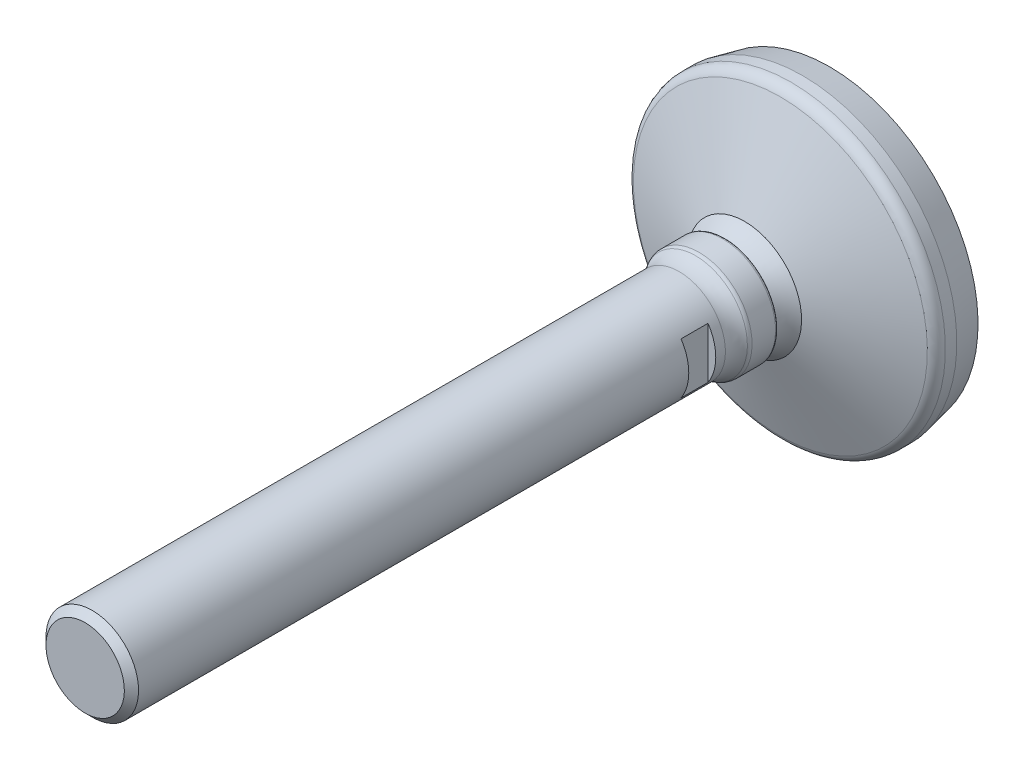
ISO-10303-21;
HEADER;
FILE_DESCRIPTION(('STEP AP214'),'2;1');
FILE_NAME('part.step','',(''),(''),'','','');
FILE_SCHEMA(('AUTOMOTIVE_DESIGN { 1 0 10303 214 1 1 1 1 }'));
ENDSEC;
DATA;
#1=APPLICATION_CONTEXT('core data for automotive mechanical design processes');
#2=APPLICATION_PROTOCOL_DEFINITION('international standard','automotive_design',2000,#1);
#3=PRODUCT_CONTEXT('',#1,'mechanical');
#4=PRODUCT('Part','Part','',(#3));
#5=PRODUCT_RELATED_PRODUCT_CATEGORY('part','',(#4));
#6=PRODUCT_DEFINITION_FORMATION('','',#4);
#7=PRODUCT_DEFINITION_CONTEXT('part definition',#1,'design');
#8=PRODUCT_DEFINITION('design','',#6,#7);
#9=PRODUCT_DEFINITION_SHAPE('','',#8);
#10=(LENGTH_UNIT() NAMED_UNIT(*) SI_UNIT(.MILLI.,.METRE.));
#11=(NAMED_UNIT(*) PLANE_ANGLE_UNIT() SI_UNIT($,.RADIAN.));
#12=(NAMED_UNIT(*) SI_UNIT($,.STERADIAN.) SOLID_ANGLE_UNIT());
#13=UNCERTAINTY_MEASURE_WITH_UNIT(LENGTH_MEASURE(1.E-05),#10,'distance_accuracy_value','');
#14=(GEOMETRIC_REPRESENTATION_CONTEXT(3) GLOBAL_UNCERTAINTY_ASSIGNED_CONTEXT((#13)) GLOBAL_UNIT_ASSIGNED_CONTEXT((#10,
#11,#12)) REPRESENTATION_CONTEXT('',''));
#15=CARTESIAN_POINT('',(0.,0.,0.));
#16=DIRECTION('',(0.,0.,1.));
#17=DIRECTION('',(1.,0.,0.));
#18=AXIS2_PLACEMENT_3D('',#15,#16,#17);
#19=CARTESIAN_POINT('',(0.,0.,30.1171837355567));
#20=DIRECTION('',(0.,0.,-1.));
#21=DIRECTION('',(0.,1.,0.));
#22=AXIS2_PLACEMENT_3D('',#19,#20,#21);
#23=TOROIDAL_SURFACE('',#22,23.5880613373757,12.);
#24=CARTESIAN_POINT('',(0.,0.,22.));
#25=DIRECTION('',(0.,0.,-1.));
#26=DIRECTION('',(0.,1.,0.));
#27=AXIS2_PLACEMENT_3D('',#24,#25,#26);
#28=CIRCLE('',#27,14.75);
#29=CARTESIAN_POINT('',(0.,14.75,22.));
#30=VERTEX_POINT('',#29);
#31=EDGE_CURVE('E86',#30,#30,#28,.T.);
#32=ORIENTED_EDGE('',*,*,#31,.F.);
#33=EDGE_LOOP('',(#32));
#34=FACE_BOUND('',#33,.T.);
#35=CARTESIAN_POINT('',(0.,0.,27.));
#36=DIRECTION('',(0.,0.,-1.));
#37=DIRECTION('',(0.,1.,0.));
#38=AXIS2_PLACEMENT_3D('',#35,#36,#37);
#39=CIRCLE('',#38,12.);
#40=CARTESIAN_POINT('',(0.,12.,27.));
#41=VERTEX_POINT('',#40);
#42=EDGE_CURVE('E61',#41,#41,#39,.T.);
#43=ORIENTED_EDGE('',*,*,#42,.T.);
#44=EDGE_LOOP('',(#43));
#45=FACE_BOUND('',#44,.T.);
#46=ADVANCED_FACE('F14',(#34,#45),#23,.F.);
#47=CARTESIAN_POINT('',(0.,0.,22.));
#48=DIRECTION('',(0.,0.,-1.));
#49=DIRECTION('',(0.,1.,0.));
#50=AXIS2_PLACEMENT_3D('',#47,#48,#49);
#51=CONICAL_SURFACE('',#50,14.75,1.19370873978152);
#52=CARTESIAN_POINT('',(0.,0.,12.7506365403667));
#53=DIRECTION('',(0.,0.,-1.));
#54=DIRECTION('',(0.,1.,0.));
#55=AXIS2_PLACEMENT_3D('',#52,#53,#54);
#56=CIRCLE('',#55,38.104642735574);
#57=CARTESIAN_POINT('',(0.,38.104642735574,12.7506365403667));
#58=VERTEX_POINT('',#57);
#59=EDGE_CURVE('E89',#58,#58,#56,.T.);
#60=ORIENTED_EDGE('',*,*,#59,.F.);
#61=EDGE_LOOP('',(#60));
#62=FACE_BOUND('',#61,.T.);
#63=ORIENTED_EDGE('',*,*,#31,.T.);
#64=EDGE_LOOP('',(#63));
#65=FACE_BOUND('',#64,.T.);
#66=ADVANCED_FACE('F147',(#62,#65),#51,.T.);
#67=CARTESIAN_POINT('',(0.,0.,9.96141363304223));
#68=DIRECTION('',(0.,0.,-1.));
#69=DIRECTION('',(0.,1.,0.));
#70=AXIS2_PLACEMENT_3D('',#67,#68,#69);
#71=TOROIDAL_SURFACE('',#70,37.,3.00000000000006);
#72=ORIENTED_EDGE('',*,*,#59,.T.);
#73=EDGE_LOOP('',(#72));
#74=FACE_BOUND('',#73,.T.);
#75=CARTESIAN_POINT('',(0.,0.,9.96141363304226));
#76=DIRECTION('',(0.,0.,-1.));
#77=DIRECTION('',(0.,1.,0.));
#78=AXIS2_PLACEMENT_3D('',#75,#76,#77);
#79=CIRCLE('',#78,40.);
#80=CARTESIAN_POINT('',(0.,40.,9.96141363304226));
#81=VERTEX_POINT('',#80);
#82=EDGE_CURVE('E92',#81,#81,#79,.T.);
#83=ORIENTED_EDGE('',*,*,#82,.F.);
#84=EDGE_LOOP('',(#83));
#85=FACE_BOUND('',#84,.T.);
#86=ADVANCED_FACE('F153',(#74,#85),#71,.T.);
#87=CARTESIAN_POINT('',(0.,0.,0.));
#88=DIRECTION('',(0.,0.,-1.));
#89=DIRECTION('',(0.,1.,0.));
#90=AXIS2_PLACEMENT_3D('',#87,#88,#89);
#91=CYLINDRICAL_SURFACE('',#90,40.);
#92=CARTESIAN_POINT('',(0.,0.,7.));
#93=DIRECTION('',(0.,0.,-1.));
#94=DIRECTION('',(0.,1.,0.));
#95=AXIS2_PLACEMENT_3D('',#92,#93,#94);
#96=CIRCLE('',#95,40.);
#97=CARTESIAN_POINT('',(0.,40.,7.));
#98=VERTEX_POINT('',#97);
#99=EDGE_CURVE('E95',#98,#98,#96,.T.);
#100=ORIENTED_EDGE('',*,*,#99,.F.);
#101=EDGE_LOOP('',(#100));
#102=FACE_BOUND('',#101,.T.);
#103=ORIENTED_EDGE('',*,*,#82,.T.);
#104=EDGE_LOOP('',(#103));
#105=FACE_BOUND('',#104,.T.);
#106=ADVANCED_FACE('F198',(#102,#105),#91,.T.);
#107=CARTESIAN_POINT('',(0.,0.,7.));
#108=DIRECTION('',(0.,0.,1.));
#109=DIRECTION('',(0.,-1.,0.));
#110=AXIS2_PLACEMENT_3D('',#107,#108,#109);
#111=CONICAL_SURFACE('',#110,40.,0.211093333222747);
#112=CARTESIAN_POINT('',(0.,0.,0.));
#113=DIRECTION('',(0.,0.,-1.));
#114=DIRECTION('',(0.,1.,0.));
#115=AXIS2_PLACEMENT_3D('',#112,#113,#114);
#116=CIRCLE('',#115,38.5);
#117=CARTESIAN_POINT('',(0.,38.5,0.));
#118=VERTEX_POINT('',#117);
#119=EDGE_CURVE('E98',#118,#118,#116,.T.);
#120=ORIENTED_EDGE('',*,*,#119,.F.);
#121=EDGE_LOOP('',(#120));
#122=FACE_BOUND('',#121,.T.);
#123=ORIENTED_EDGE('',*,*,#99,.T.);
#124=EDGE_LOOP('',(#123));
#125=FACE_BOUND('',#124,.T.);
#126=ADVANCED_FACE('F194',(#122,#125),#111,.T.);
#127=CARTESIAN_POINT('',(38.5,0.,0.));
#128=DIRECTION('',(0.,0.,1.));
#129=DIRECTION('',(0.,-1.,0.));
#130=AXIS2_PLACEMENT_3D('',#127,#128,#129);
#131=PLANE('',#130);
#132=ORIENTED_EDGE('',*,*,#119,.T.);
#133=EDGE_LOOP('',(#132));
#134=FACE_BOUND('',#133,.T.);
#135=ADVANCED_FACE('F187',(#134),#131,.F.);
#136=CARTESIAN_POINT('',(0.,0.,12.5));
#137=DIRECTION('',(0.,0.,-1.));
#138=DIRECTION('',(0.,1.,0.));
#139=AXIS2_PLACEMENT_3D('',#136,#137,#138);
#140=CYLINDRICAL_SURFACE('',#139,12.);
#141=CARTESIAN_POINT('',(0.,0.,39.));
#142=DIRECTION('',(0.,0.,-1.));
#143=DIRECTION('',(0.,1.,0.));
#144=AXIS2_PLACEMENT_3D('',#141,#142,#143);
#145=CIRCLE('',#144,12.);
#146=CARTESIAN_POINT('',(0.,12.,39.));
#147=VERTEX_POINT('',#146);
#148=EDGE_CURVE('E107',#147,#147,#145,.T.);
#149=ORIENTED_EDGE('',*,*,#148,.F.);
#150=EDGE_LOOP('',(#149));
#151=FACE_BOUND('',#150,.T.);
#152=DIRECTION('',(0.,0.,-1.));
#153=VECTOR('',#152,1.);
#154=CARTESIAN_POINT('',(10.,-6.6332495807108,12.5));
#155=LINE('',#154,#153);
#156=CARTESIAN_POINT('',(10.,-6.6332495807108,41.5));
#157=VERTEX_POINT('',#156);
#158=CARTESIAN_POINT('',(10.,-6.6332495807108,48.5));
#159=VERTEX_POINT('',#158);
#160=EDGE_CURVE('E77',#157,#159,#155,.F.);
#161=ORIENTED_EDGE('',*,*,#160,.T.);
#162=CARTESIAN_POINT('',(0.,0.,48.5));
#163=DIRECTION('',(0.,0.,1.));
#164=DIRECTION('',(0.,-1.,0.));
#165=AXIS2_PLACEMENT_3D('',#162,#163,#164);
#166=CIRCLE('',#165,12.);
#167=CARTESIAN_POINT('',(10.,6.6332495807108,48.5));
#168=VERTEX_POINT('',#167);
#169=EDGE_CURVE('E9',#159,#168,#166,.T.);
#170=ORIENTED_EDGE('',*,*,#169,.T.);
#171=DIRECTION('',(0.,0.,-1.));
#172=VECTOR('',#171,1.);
#173=CARTESIAN_POINT('',(10.,6.6332495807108,12.5));
#174=LINE('',#173,#172);
#175=CARTESIAN_POINT('',(10.,6.6332495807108,41.5));
#176=VERTEX_POINT('',#175);
#177=EDGE_CURVE('E17',#168,#176,#174,.T.);
#178=ORIENTED_EDGE('',*,*,#177,.T.);
#179=CARTESIAN_POINT('',(0.,0.,41.5));
#180=DIRECTION('',(0.,0.,1.));
#181=DIRECTION('',(0.,-1.,0.));
#182=AXIS2_PLACEMENT_3D('',#179,#180,#181);
#183=CIRCLE('',#182,12.);
#184=EDGE_CURVE('E63',#157,#176,#183,.T.);
#185=ORIENTED_EDGE('',*,*,#184,.F.);
#186=EDGE_LOOP('',(#161,#170,#178,#185));
#187=FACE_BOUND('',#186,.T.);
#188=DIRECTION('',(0.,0.,-1.));
#189=VECTOR('',#188,1.);
#190=CARTESIAN_POINT('',(-10.,6.6332495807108,12.5));
#191=LINE('',#190,#189);
#192=CARTESIAN_POINT('',(-10.,6.6332495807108,41.5));
#193=VERTEX_POINT('',#192);
#194=CARTESIAN_POINT('',(-10.,6.6332495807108,48.5));
#195=VERTEX_POINT('',#194);
#196=EDGE_CURVE('E60',#193,#195,#191,.F.);
#197=ORIENTED_EDGE('',*,*,#196,.T.);
#198=CARTESIAN_POINT('',(-10.,-6.6332495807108,48.5));
#199=VERTEX_POINT('',#198);
#200=EDGE_CURVE('E23',#195,#199,#166,.T.);
#201=ORIENTED_EDGE('',*,*,#200,.T.);
#202=DIRECTION('',(0.,0.,-1.));
#203=VECTOR('',#202,1.);
#204=CARTESIAN_POINT('',(-10.,-6.6332495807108,12.5));
#205=LINE('',#204,#203);
#206=CARTESIAN_POINT('',(-10.,-6.6332495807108,41.5));
#207=VERTEX_POINT('',#206);
#208=EDGE_CURVE('E67',#199,#207,#205,.T.);
#209=ORIENTED_EDGE('',*,*,#208,.T.);
#210=EDGE_CURVE('E55',#193,#207,#183,.T.);
#211=ORIENTED_EDGE('',*,*,#210,.F.);
#212=EDGE_LOOP('',(#197,#201,#209,#211));
#213=FACE_BOUND('',#212,.T.);
#214=CARTESIAN_POINT('',(0.,0.,191.1595));
#215=DIRECTION('',(0.,0.,-1.));
#216=DIRECTION('',(0.,1.,0.));
#217=AXIS2_PLACEMENT_3D('',#214,#215,#216);
#218=CIRCLE('',#217,12.);
#219=CARTESIAN_POINT('',(0.,12.,191.1595));
#220=VERTEX_POINT('',#219);
#221=EDGE_CURVE('E104',#220,#220,#218,.T.);
#222=ORIENTED_EDGE('',*,*,#221,.T.);
#223=EDGE_LOOP('',(#222));
#224=FACE_BOUND('',#223,.T.);
#225=ADVANCED_FACE('F73',(#151,#187,#213,#224),#140,.T.);
#226=CARTESIAN_POINT('',(0.,0.,39.));
#227=DIRECTION('',(0.,0.,-1.));
#228=DIRECTION('',(0.,1.,0.));
#229=AXIS2_PLACEMENT_3D('',#226,#227,#228);
#230=TOROIDAL_SURFACE('',#229,19.,7.);
#231=CARTESIAN_POINT('',(0.,0.,34.7456515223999));
#232=DIRECTION('',(0.,0.,-1.));
#233=DIRECTION('',(0.,1.,0.));
#234=AXIS2_PLACEMENT_3D('',#231,#232,#233);
#235=CIRCLE('',#234,13.4411764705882);
#236=CARTESIAN_POINT('',(0.,13.4411764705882,34.7456515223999));
#237=VERTEX_POINT('',#236);
#238=EDGE_CURVE('E110',#237,#237,#235,.T.);
#239=ORIENTED_EDGE('',*,*,#238,.F.);
#240=EDGE_LOOP('',(#239));
#241=FACE_BOUND('',#240,.T.);
#242=ORIENTED_EDGE('',*,*,#148,.T.);
#243=EDGE_LOOP('',(#242));
#244=FACE_BOUND('',#243,.T.);
#245=ADVANCED_FACE('F180',(#241,#244),#230,.F.);
#246=CARTESIAN_POINT('',(0.,0.,33.8340054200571));
#247=DIRECTION('',(0.,0.,-1.));
#248=DIRECTION('',(0.,1.,0.));
#249=AXIS2_PLACEMENT_3D('',#246,#247,#248);
#250=TOROIDAL_SURFACE('',#249,12.25,1.49999999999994);
#251=ORIENTED_EDGE('',*,*,#238,.T.);
#252=EDGE_LOOP('',(#251));
#253=FACE_BOUND('',#252,.T.);
#254=CARTESIAN_POINT('',(0.,0.,33.8340054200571));
#255=DIRECTION('',(0.,0.,-1.));
#256=DIRECTION('',(0.,1.,0.));
#257=AXIS2_PLACEMENT_3D('',#254,#255,#256);
#258=CIRCLE('',#257,13.75);
#259=CARTESIAN_POINT('',(0.,13.75,33.8340054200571));
#260=VERTEX_POINT('',#259);
#261=EDGE_CURVE('E113',#260,#260,#258,.T.);
#262=ORIENTED_EDGE('',*,*,#261,.F.);
#263=EDGE_LOOP('',(#262));
#264=FACE_BOUND('',#263,.T.);
#265=ADVANCED_FACE('F173',(#253,#264),#250,.T.);
#266=CARTESIAN_POINT('',(0.,0.,12.5));
#267=DIRECTION('',(0.,0.,-1.));
#268=DIRECTION('',(0.,1.,0.));
#269=AXIS2_PLACEMENT_3D('',#266,#267,#268);
#270=CYLINDRICAL_SURFACE('',#269,13.75);
#271=CARTESIAN_POINT('',(0.,0.,27.75));
#272=DIRECTION('',(0.,0.,-1.));
#273=DIRECTION('',(0.,1.,0.));
#274=AXIS2_PLACEMENT_3D('',#271,#272,#273);
#275=CIRCLE('',#274,13.75);
#276=CARTESIAN_POINT('',(0.,13.75,27.75));
#277=VERTEX_POINT('',#276);
#278=EDGE_CURVE('E116',#277,#277,#275,.T.);
#279=ORIENTED_EDGE('',*,*,#278,.F.);
#280=EDGE_LOOP('',(#279));
#281=FACE_BOUND('',#280,.T.);
#282=ORIENTED_EDGE('',*,*,#261,.T.);
#283=EDGE_LOOP('',(#282));
#284=FACE_BOUND('',#283,.T.);
#285=ADVANCED_FACE('F166',(#281,#284),#270,.T.);
#286=CARTESIAN_POINT('',(0.,0.,27.75));
#287=DIRECTION('',(0.,0.,-1.));
#288=DIRECTION('',(0.,1.,0.));
#289=AXIS2_PLACEMENT_3D('',#286,#287,#288);
#290=TOROIDAL_SURFACE('',#289,13.,0.75);
#291=ORIENTED_EDGE('',*,*,#278,.T.);
#292=EDGE_LOOP('',(#291));
#293=FACE_BOUND('',#292,.T.);
#294=CARTESIAN_POINT('',(0.,0.,27.));
#295=DIRECTION('',(0.,0.,-1.));
#296=DIRECTION('',(0.,1.,0.));
#297=AXIS2_PLACEMENT_3D('',#294,#295,#296);
#298=CIRCLE('',#297,13.);
#299=CARTESIAN_POINT('',(0.,13.,27.));
#300=VERTEX_POINT('',#299);
#301=EDGE_CURVE('E119',#300,#300,#298,.T.);
#302=ORIENTED_EDGE('',*,*,#301,.F.);
#303=EDGE_LOOP('',(#302));
#304=FACE_BOUND('',#303,.T.);
#305=ADVANCED_FACE('F161',(#293,#304),#290,.T.);
#306=CARTESIAN_POINT('',(13.,0.,27.));
#307=DIRECTION('',(0.,0.,1.));
#308=DIRECTION('',(0.,-1.,0.));
#309=AXIS2_PLACEMENT_3D('',#306,#307,#308);
#310=PLANE('',#309);
#311=ORIENTED_EDGE('',*,*,#42,.F.);
#312=EDGE_LOOP('',(#311));
#313=FACE_BOUND('',#312,.T.);
#314=ORIENTED_EDGE('',*,*,#301,.T.);
#315=EDGE_LOOP('',(#314));
#316=FACE_BOUND('',#315,.T.);
#317=ADVANCED_FACE('F145',(#313,#316),#310,.F.);
#318=CARTESIAN_POINT('',(0.,0.,41.5));
#319=DIRECTION('',(0.,0.,1.));
#320=DIRECTION('',(0.,-1.,0.));
#321=AXIS2_PLACEMENT_3D('',#318,#319,#320);
#322=PLANE('',#321);
#323=ORIENTED_EDGE('',*,*,#210,.T.);
#324=DIRECTION('',(0.,-1.,0.));
#325=VECTOR('',#324,1.);
#326=CARTESIAN_POINT('',(-10.,24.,41.5));
#327=LINE('',#326,#325);
#328=EDGE_CURVE('E29',#193,#207,#327,.T.);
#329=ORIENTED_EDGE('',*,*,#328,.F.);
#330=EDGE_LOOP('',(#323,#329));
#331=FACE_BOUND('',#330,.T.);
#332=ADVANCED_FACE('F56',(#331),#322,.T.);
#333=CARTESIAN_POINT('',(0.,0.,48.5));
#334=DIRECTION('',(0.,0.,1.));
#335=DIRECTION('',(0.,-1.,0.));
#336=AXIS2_PLACEMENT_3D('',#333,#334,#335);
#337=PLANE('',#336);
#338=DIRECTION('',(0.,-1.,0.));
#339=VECTOR('',#338,1.);
#340=CARTESIAN_POINT('',(-10.,24.,48.5));
#341=LINE('',#340,#339);
#342=EDGE_CURVE('E121',#195,#199,#341,.T.);
#343=ORIENTED_EDGE('',*,*,#342,.T.);
#344=ORIENTED_EDGE('',*,*,#200,.F.);
#345=EDGE_LOOP('',(#343,#344));
#346=FACE_BOUND('',#345,.T.);
#347=ADVANCED_FACE('F142',(#346),#337,.F.);
#348=CARTESIAN_POINT('',(-10.,24.,48.5));
#349=DIRECTION('',(1.,0.,0.));
#350=DIRECTION('',(0.,1.,0.));
#351=AXIS2_PLACEMENT_3D('',#348,#349,#350);
#352=PLANE('',#351);
#353=ORIENTED_EDGE('',*,*,#342,.F.);
#354=ORIENTED_EDGE('',*,*,#196,.F.);
#355=ORIENTED_EDGE('',*,*,#328,.T.);
#356=ORIENTED_EDGE('',*,*,#208,.F.);
#357=EDGE_LOOP('',(#353,#354,#355,#356));
#358=FACE_BOUND('',#357,.T.);
#359=ADVANCED_FACE('F66',(#358),#352,.F.);
#360=CARTESIAN_POINT('',(10.,-24.,48.5));
#361=DIRECTION('',(-1.,0.,0.));
#362=DIRECTION('',(0.,-1.,0.));
#363=AXIS2_PLACEMENT_3D('',#360,#361,#362);
#364=PLANE('',#363);
#365=DIRECTION('',(0.,1.,0.));
#366=VECTOR('',#365,1.);
#367=CARTESIAN_POINT('',(10.,-24.,48.5));
#368=LINE('',#367,#366);
#369=EDGE_CURVE('E69',#159,#168,#368,.T.);
#370=ORIENTED_EDGE('',*,*,#369,.F.);
#371=ORIENTED_EDGE('',*,*,#160,.F.);
#372=DIRECTION('',(0.,1.,0.));
#373=VECTOR('',#372,1.);
#374=CARTESIAN_POINT('',(10.,-24.,41.5));
#375=LINE('',#374,#373);
#376=EDGE_CURVE('E70',#157,#176,#375,.T.);
#377=ORIENTED_EDGE('',*,*,#376,.T.);
#378=ORIENTED_EDGE('',*,*,#177,.F.);
#379=EDGE_LOOP('',(#370,#371,#377,#378));
#380=FACE_BOUND('',#379,.T.);
#381=ADVANCED_FACE('F127',(#380),#364,.F.);
#382=ORIENTED_EDGE('',*,*,#369,.T.);
#383=ORIENTED_EDGE('',*,*,#169,.F.);
#384=EDGE_LOOP('',(#382,#383));
#385=FACE_BOUND('',#384,.T.);
#386=ADVANCED_FACE('F126',(#385),#337,.F.);
#387=ORIENTED_EDGE('',*,*,#376,.F.);
#388=ORIENTED_EDGE('',*,*,#184,.T.);
#389=EDGE_LOOP('',(#387,#388));
#390=FACE_BOUND('',#389,.T.);
#391=ADVANCED_FACE('F128',(#390),#322,.T.);
#392=CARTESIAN_POINT('',(0.,0.,193.));
#393=DIRECTION('',(0.,0.,-1.));
#394=DIRECTION('',(0.,1.,0.));
#395=AXIS2_PLACEMENT_3D('',#392,#393,#394);
#396=PLANE('',#395);
#397=CARTESIAN_POINT('',(0.,0.,193.));
#398=DIRECTION('',(0.,0.,-1.));
#399=DIRECTION('',(0.,1.,0.));
#400=AXIS2_PLACEMENT_3D('',#397,#398,#399);
#401=CIRCLE('',#400,10.1595);
#402=CARTESIAN_POINT('',(0.,10.1595,193.));
#403=VERTEX_POINT('',#402);
#404=EDGE_CURVE('E101',#403,#403,#401,.T.);
#405=ORIENTED_EDGE('',*,*,#404,.F.);
#406=EDGE_LOOP('',(#405));
#407=FACE_BOUND('',#406,.T.);
#408=ADVANCED_FACE('F130',(#407),#396,.F.);
#409=CARTESIAN_POINT('',(0.,0.,193.));
#410=DIRECTION('',(0.,0.,-1.));
#411=DIRECTION('',(0.,1.,0.));
#412=AXIS2_PLACEMENT_3D('',#409,#410,#411);
#413=CONICAL_SURFACE('',#412,10.1595,0.78539816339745);
#414=ORIENTED_EDGE('',*,*,#221,.F.);
#415=EDGE_LOOP('',(#414));
#416=FACE_BOUND('',#415,.T.);
#417=ORIENTED_EDGE('',*,*,#404,.T.);
#418=EDGE_LOOP('',(#417));
#419=FACE_BOUND('',#418,.T.);
#420=ADVANCED_FACE('F138',(#416,#419),#413,.T.);
#421=CLOSED_SHELL('',(#46,#66,#86,#106,#126,#135,#225,#245,#265,#285,#305,#317,#332,#347,#359,
#381,#386,#391,#408,#420));
#422=MANIFOLD_SOLID_BREP('B1',#421);
#423=ADVANCED_BREP_SHAPE_REPRESENTATION('',(#18,#422),#14);
#424=SHAPE_DEFINITION_REPRESENTATION(#9,#423);
ENDSEC;
END-ISO-10303-21;
